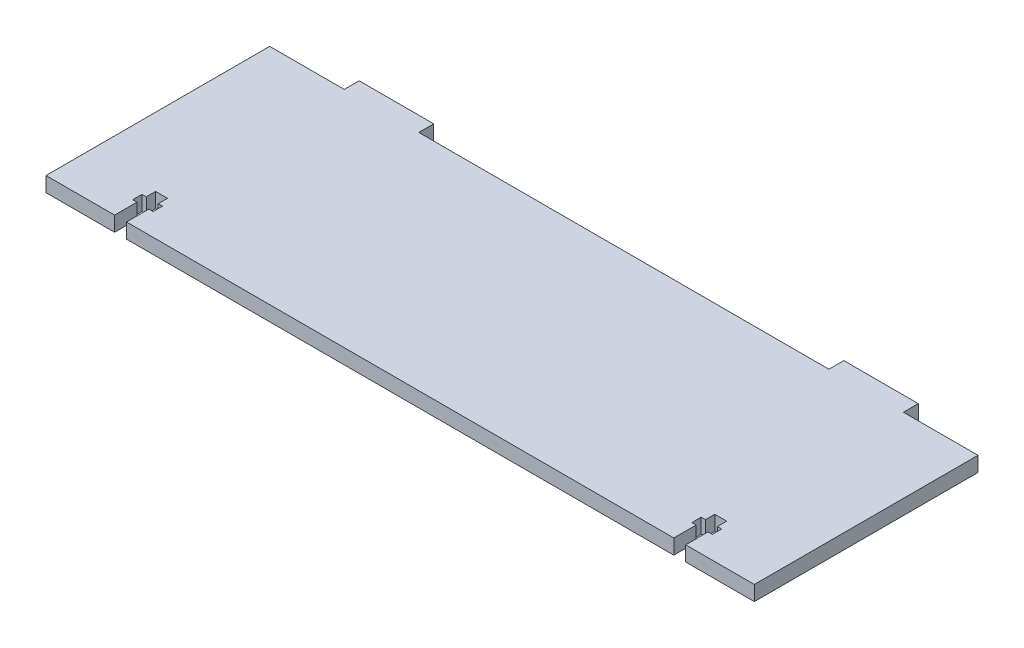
from build123d import *

# Parameters (mm, degrees)
AUFSATZ_LINEAR_AUSTRAGEN1_DEPTH = 4


with BuildPart() as part:
    # Skizze1 → Aufsatz-Linear austragen1 (new body)
    with BuildSketch(Plane(origin=(0, 0, 0), x_dir=(1, 0, 0), z_dir=(0, 1, 0))):
        Polygon((-95, 30), (-75, 30), (-75, 34), (-55, 34), (-55, 30), (55, 30), (55, 34), (75, 34), (75, 30), (95, 30), (95, -30), (76.6, -30), (76.6, -24), (77.75, -24), (77.75, -21.5), (76.6, -21.5), (76.6, -19), (73.4, -19), (73.4, -21.5), (72.25, -21.5), (72.25, -24), (73.4, -24), (73.4, -30), (-73.4, -30), (-73.4, -24), (-72.25, -24), (-72.25, -21.5), (-73.4, -21.5), (-73.4, -19), (-76.6, -19), (-76.6, -21.5), (-77.75, -21.5), (-77.75, -24), (-76.6, -24), (-76.6, -30), (-95, -30), align=None)
    extrude(amount=AUFSATZ_LINEAR_AUSTRAGEN1_DEPTH)


solid = part.part
